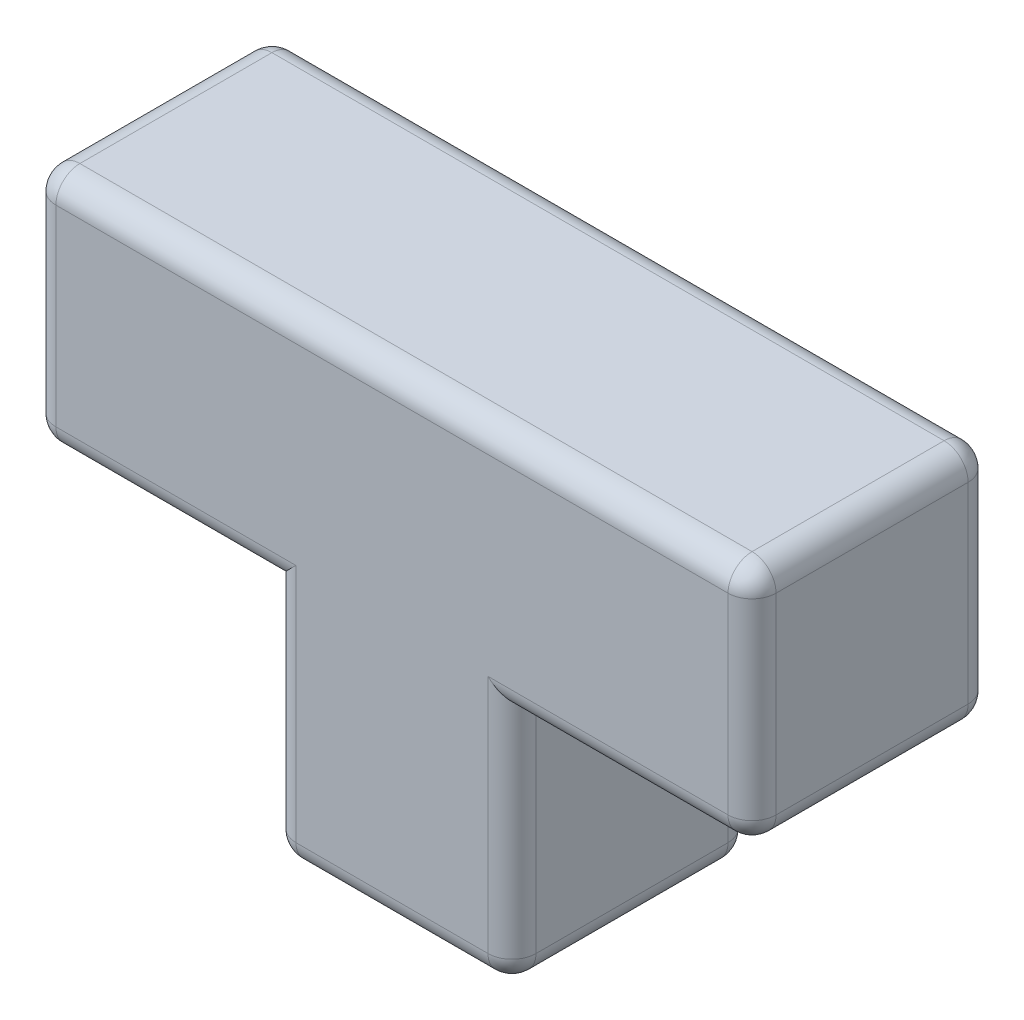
from build123d import *

# Parameters (mm, degrees)
BOSS_EXTRUDE1_DEPTH = 100
FILLET3_R           = 10


with BuildPart() as part:
    # Sketch1 → Boss-Extrude1 (new body)
    with BuildSketch(Plane.XY):
        Polygon((-326.4, 114.740311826), (-26.4, 114.740311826), (-26.4, 14.740311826), (-126.4, 14.740311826), (-126.4, -85.259688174), (-226.4, -85.259688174), (-226.4, 14.740311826), (-326.4, 14.740311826), align=None)
    extrude(amount=BOSS_EXTRUDE1_DEPTH)

    # Fillet3
    fillet3_edges = [part.edges().sort_by_distance(p)[0] for p in [
        (-226.4, -35.259688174, 100),
        (-276.4, 14.740311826, 0),
        (-326.4, 64.740311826, 0),
        (-176.4, -85.259688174, 100),
        (-326.4, 114.740311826, 50),
        (-26.4, 114.740311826, 50),
        (-26.4, 14.740311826, 50),
        (-126.4, -85.259688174, 50),
        (-226.4, -85.259688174, 50),
        (-326.4, 14.740311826, 50),
        (-126.4, -35.259688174, 100),
        (-76.4, 14.740311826, 100),
        (-26.4, 64.740311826, 100),
        (-176.4, 114.740311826, 100),
        (-326.4, 64.740311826, 100),
        (-276.4, 14.740311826, 100),
        (-176.4, 114.740311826, 0),
        (-26.4, 64.740311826, 0),
        (-76.4, 14.740311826, 0),
        (-126.4, -35.259688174, 0),
        (-176.4, -85.259688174, 0),
        (-226.4, -35.259688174, 0),
    ]]
    fillet(fillet3_edges, radius=FILLET3_R)


solid = part.part
